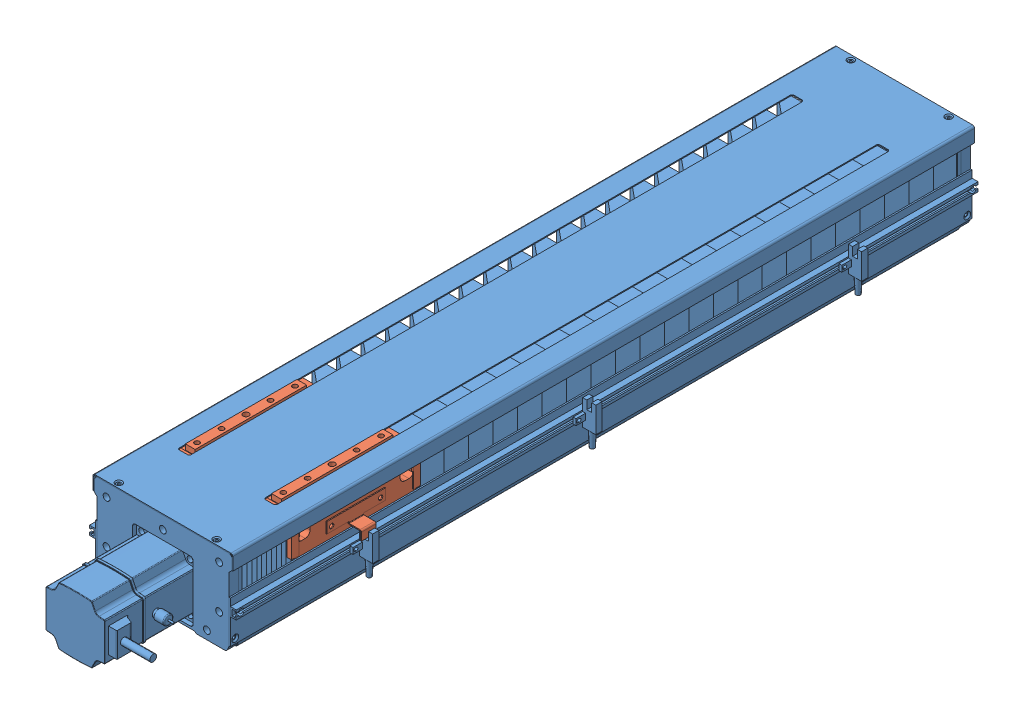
SolidWorks assembly 装配体10.sldasm, configuration 默认 (file format 9000). Lengths in mm.
Overall size (163.4 91 847.5).
2 component instances, 2 part files, 3 mates.
Components (placement in the parent):
- TCD135PS500-风琴罩滑台-1: TCD135PS500-风琴罩滑台.SLDPRT [默认] at (484.4113 188.0611 590.8377) size (163.4 89.5 847.5)
- TCD135PS100-滑台-1: TCD135PS100-滑台.SLDPRT [默认] at (484.4113 188.0611 790.8377) size (150 75.5 138)
Mates (geometry in assembly coordinates):
- 同心1: concentric anti-aligned: cylinder of TCD135PS500-风琴罩滑台-1 through (484.4113 223.5611 922.3377) axis (0 0 1) radius 8; cylinder of TCD135PS100-滑台-1 through (484.4113 223.5611 905.8377) axis (0 0 -1) radius 14.25
- LimitDistance1: limit distance = 12 mm anti-aligned: plane of TCD135PS100-滑台-1 through (484.4113 219.5611 860.8377) normal (0 0 1); plane of TCD135PS500-风琴罩滑台-1 through (448.9113 223.5611 872.8377) normal (0 0 -1)
- 平行1: parallel aligned: plane of TCD135PS500-风琴罩滑台-1 through (484.4113 277.5611 590.8377) normal (0 1 0); plane of TCD135PS100-滑台-1 through (384.9113 273.5611 783.8377) normal (0 1 0)
